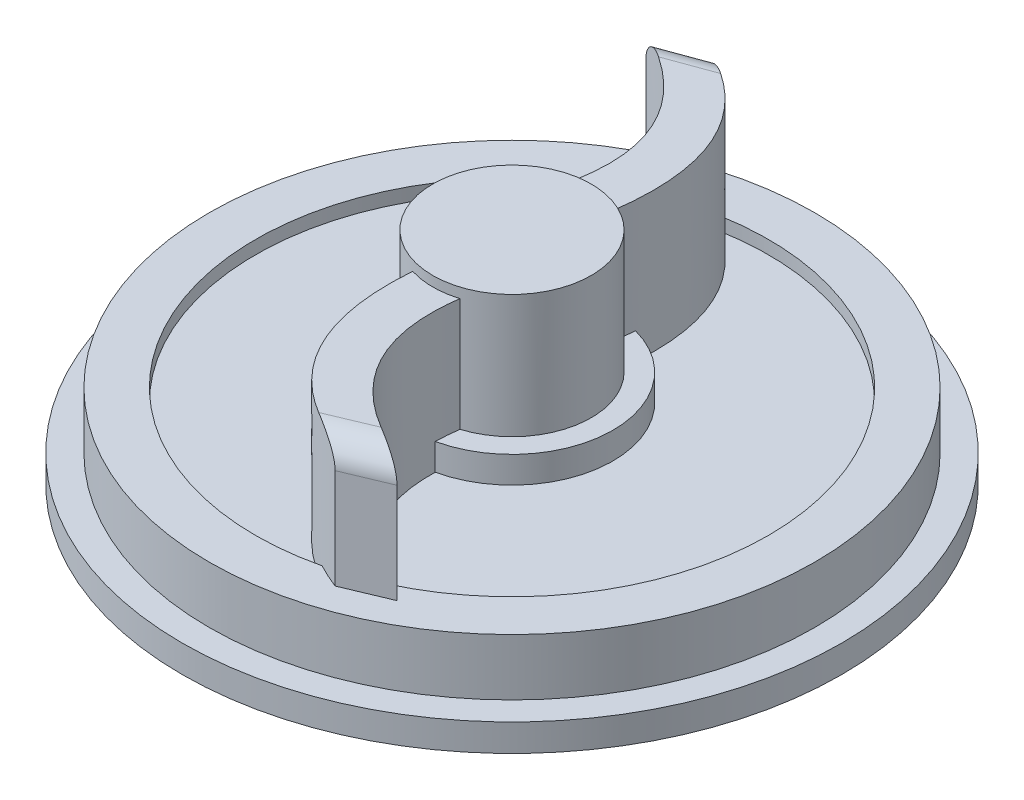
from build123d import *

# Parameters (mm, degrees)
SKETCH1_R           = 12.573
BOSS_EXTRUDE1_DEPTH = 1.0414
SKETCH2_R           = 11.5443
BOSS_EXTRUDE2_DEPTH = 2.159
SKETCH3_R           = 9.779
CUT_EXTRUDE1_DEPTH  = 0.508
SKETCH5_R           = 3.8481
BOSS_EXTRUDE3_DEPTH = 1.016
SKETCH6_R           = 3.0226
BOSS_EXTRUDE4_DEPTH = 4.699
BOSS_EXTRUDE6_DEPTH = 5.334
FILLET2_R           = 1.016
FILLET3_R           = 1.016
SKETCH8_R           = 10.0584
CUT_EXTRUDE2_DEPTH  = 0.762
SKETCH9_R           = 3.3909
BOSS_EXTRUDE7_DEPTH = 2.794
SKETCH10_W          = 3.556
SKETCH10_H          = 3.556
CUT_EXTRUDE3_DEPTH  = 6.35


with BuildPart() as part:
    # Sketch1 → Boss-Extrude1 (new body)
    with BuildSketch(Plane(origin=(0, 0, 0), x_dir=(1, 0, 0), z_dir=(0, 1, 0))):
        with Locations(Location((0, 0, 0), (0, 0, 270))):
            Circle(SKETCH1_R)
    extrude(amount=BOSS_EXTRUDE1_DEPTH)

    # Sketch2 → Boss-Extrude2 (add)
    with BuildSketch(Plane(origin=(0, 1.0414, 0), x_dir=(1, 0, 0), z_dir=(0, 1, 0))):
        with Locations(Location((0, 0, 0), (0, 0, 270))):
            Circle(SKETCH2_R)
    extrude(amount=BOSS_EXTRUDE2_DEPTH)

    # Sketch3 → Cut-Extrude1 (cut)
    with BuildSketch(Plane(origin=(0, 3.2004, 0), x_dir=(1, 0, 0), z_dir=(0, 1, 0))):
        with Locations(Location((0, 0, 0), (0, 0, 270))):
            Circle(SKETCH3_R)
    extrude(amount=-CUT_EXTRUDE1_DEPTH, mode=Mode.SUBTRACT)

    # Sketch5 → Boss-Extrude3 (add)
    with BuildSketch(Plane(origin=(0, 2.6924, 0), x_dir=(1, 0, 0), z_dir=(0, 1, 0))):
        with Locations(Location((0, 0, 0), (0, 0, 270))):
            Circle(SKETCH5_R)
    extrude(amount=BOSS_EXTRUDE3_DEPTH)

    # Sketch6 → Boss-Extrude4 (add)
    with BuildSketch(Plane(origin=(0, 3.7084, 0), x_dir=(1, 0, 0), z_dir=(0, 1, 0))):
        with Locations(Location((0, 0, 0), (0, 0, 270))):
            Circle(SKETCH6_R)
    extrude(amount=BOSS_EXTRUDE4_DEPTH)

    # Sketch7 → Boss-Extrude6 (add)
    with BuildSketch(Plane(origin=(0, 2.6924, 0), x_dir=(1, 0, 0), z_dir=(0, 1, 0))):
        with BuildLine():
            Line((-0.9017, -2.884969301), (0.9017, -2.884969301))
            add(Edge.make_bspline(
                [(0.9017, -2.884969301), (0.276736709, -7.329081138), (4.848736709, -9.234969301)],
                knots=[0, 0, 0, 1, 1, 1], degree=2))
            Line((4.848736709, -9.234969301), (3.185541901, -9.932131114))
            add(Edge.make_bspline(
                [(-0.9017, -2.884969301), (-1.31205563, -8.18230471), (3.185541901, -9.932131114)],
                knots=[0, 0, 0, 1, 1, 1], degree=2))
        make_face()
        with BuildLine():
            Line((-0.9017, 2.884969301), (0.9017, 2.884969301))
            add(Edge.make_bspline(
                [(0.9017, 2.884969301), (1.664841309, 8.218969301), (-2.750930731, 10.166078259)],
                knots=[0, 0, 0, 1, 1, 1], degree=2))
            Line((-2.750930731, 10.166078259), (-4.445, 9.547708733))
            add(Edge.make_bspline(
                [(-0.9017, 2.884969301), (0.127, 7.277005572), (-4.445, 9.547708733)],
                knots=[0, 0, 0, 1, 1, 1], degree=2))
        make_face()
    extrude(amount=BOSS_EXTRUDE6_DEPTH)

    # Fillet2
    fillet2_edges = [part.edges().sort_by_distance(p)[0] for p in [
        (4.017139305, 8.0264, 9.583550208),
    ]]
    fillet(fillet2_edges, radius=FILLET2_R)

    # Fillet3
    fillet3_edges = [part.edges().sort_by_distance(p)[0] for p in [
        (-3.597965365, 8.0264, -9.856893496),
    ]]
    fillet(fillet3_edges, radius=FILLET3_R)

    # Sketch8 → Cut-Extrude2 (cut)
    with BuildSketch(Plane.XZ):
        with Locations(Location((0, 0, 0), (0, 0, 270))):
            Circle(SKETCH8_R)
    extrude(amount=-CUT_EXTRUDE2_DEPTH, mode=Mode.SUBTRACT)

    # Sketch9 → Boss-Extrude7 (add)
    with BuildSketch(Plane.XZ.offset(-0.762)):
        with Locations(Location((0, 0, 0), (0, 0, 270))):
            Circle(SKETCH9_R)
    extrude(amount=BOSS_EXTRUDE7_DEPTH)

    # Sketch10 → Cut-Extrude3 (cut)
    with BuildSketch(Plane.XZ.offset(2.032)):
        Rectangle(SKETCH10_W, SKETCH10_H)
    extrude(amount=-CUT_EXTRUDE3_DEPTH, mode=Mode.SUBTRACT)


solid = part.part
